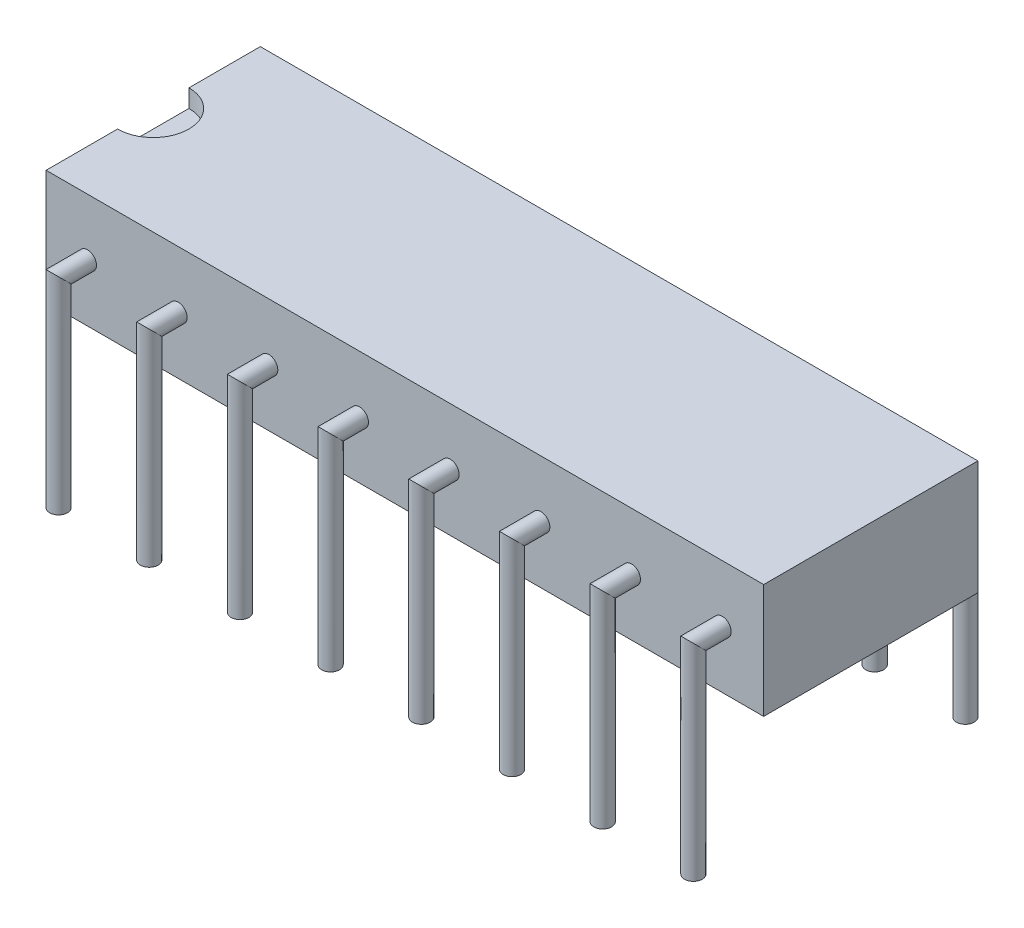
ISO-10303-21;
HEADER;
FILE_DESCRIPTION(('STEP AP214'),'2;1');
FILE_NAME('part.step','',(''),(''),'','','');
FILE_SCHEMA(('AUTOMOTIVE_DESIGN { 1 0 10303 214 1 1 1 1 }'));
ENDSEC;
DATA;
#1=APPLICATION_CONTEXT('core data for automotive mechanical design processes');
#2=APPLICATION_PROTOCOL_DEFINITION('international standard','automotive_design',2000,#1);
#3=PRODUCT_CONTEXT('',#1,'mechanical');
#4=PRODUCT('Part','Part','',(#3));
#5=PRODUCT_RELATED_PRODUCT_CATEGORY('part','',(#4));
#6=PRODUCT_DEFINITION_FORMATION('','',#4);
#7=PRODUCT_DEFINITION_CONTEXT('part definition',#1,'design');
#8=PRODUCT_DEFINITION('design','',#6,#7);
#9=PRODUCT_DEFINITION_SHAPE('','',#8);
#10=(LENGTH_UNIT() NAMED_UNIT(*) SI_UNIT(.MILLI.,.METRE.));
#11=(NAMED_UNIT(*) PLANE_ANGLE_UNIT() SI_UNIT($,.RADIAN.));
#12=(NAMED_UNIT(*) SI_UNIT($,.STERADIAN.) SOLID_ANGLE_UNIT());
#13=UNCERTAINTY_MEASURE_WITH_UNIT(LENGTH_MEASURE(1.E-05),#10,'distance_accuracy_value','');
#14=(GEOMETRIC_REPRESENTATION_CONTEXT(3) GLOBAL_UNCERTAINTY_ASSIGNED_CONTEXT((#13)) GLOBAL_UNIT_ASSIGNED_CONTEXT((#10,
#11,#12)) REPRESENTATION_CONTEXT('',''));
#15=CARTESIAN_POINT('',(0.,0.,0.));
#16=DIRECTION('',(0.,0.,1.));
#17=DIRECTION('',(1.,0.,0.));
#18=AXIS2_PLACEMENT_3D('',#15,#16,#17);
#19=CARTESIAN_POINT('',(20.1,3.2,3.));
#20=DIRECTION('',(0.,0.,-1.));
#21=DIRECTION('',(-1.,0.,0.));
#22=AXIS2_PLACEMENT_3D('',#19,#20,#21);
#23=PLANE('',#22);
#24=CARTESIAN_POINT('',(16.4,1.6,3.));
#25=DIRECTION('',(0.,0.,-1.));
#26=DIRECTION('',(-1.,0.,0.));
#27=AXIS2_PLACEMENT_3D('',#24,#25,#26);
#28=CIRCLE('',#27,0.25);
#29=CARTESIAN_POINT('',(16.15,1.6,3.));
#30=VERTEX_POINT('',#29);
#31=EDGE_CURVE('E57',#30,#30,#28,.F.);
#32=ORIENTED_EDGE('',*,*,#31,.F.);
#33=EDGE_LOOP('',(#32));
#34=FACE_BOUND('',#33,.T.);
#35=CARTESIAN_POINT('',(11.32,1.6,3.));
#36=DIRECTION('',(0.,0.,-1.));
#37=DIRECTION('',(-1.,0.,0.));
#38=AXIS2_PLACEMENT_3D('',#35,#36,#37);
#39=CIRCLE('',#38,0.25);
#40=CARTESIAN_POINT('',(11.07,1.6,3.));
#41=VERTEX_POINT('',#40);
#42=EDGE_CURVE('E166',#41,#41,#39,.F.);
#43=ORIENTED_EDGE('',*,*,#42,.F.);
#44=EDGE_LOOP('',(#43));
#45=FACE_BOUND('',#44,.T.);
#46=CARTESIAN_POINT('',(6.24,1.6,3.));
#47=DIRECTION('',(0.,0.,-1.));
#48=DIRECTION('',(-1.,0.,0.));
#49=AXIS2_PLACEMENT_3D('',#46,#47,#48);
#50=CIRCLE('',#49,0.25);
#51=CARTESIAN_POINT('',(5.99,1.6,3.));
#52=VERTEX_POINT('',#51);
#53=EDGE_CURVE('E160',#52,#52,#50,.F.);
#54=ORIENTED_EDGE('',*,*,#53,.F.);
#55=EDGE_LOOP('',(#54));
#56=FACE_BOUND('',#55,.T.);
#57=CARTESIAN_POINT('',(1.16,1.6,3.));
#58=DIRECTION('',(0.,0.,-1.));
#59=DIRECTION('',(-1.,0.,0.));
#60=AXIS2_PLACEMENT_3D('',#57,#58,#59);
#61=CIRCLE('',#60,0.25);
#62=CARTESIAN_POINT('',(0.91,1.6,3.));
#63=VERTEX_POINT('',#62);
#64=EDGE_CURVE('E154',#63,#63,#61,.F.);
#65=ORIENTED_EDGE('',*,*,#64,.F.);
#66=EDGE_LOOP('',(#65));
#67=FACE_BOUND('',#66,.T.);
#68=DIRECTION('',(0.,-1.,0.));
#69=VECTOR('',#68,1.);
#70=CARTESIAN_POINT('',(0.,3.2,3.));
#71=LINE('',#70,#69);
#72=CARTESIAN_POINT('',(0.,3.2,3.));
#73=VERTEX_POINT('',#72);
#74=CARTESIAN_POINT('',(0.,0.,3.));
#75=VERTEX_POINT('',#74);
#76=EDGE_CURVE('E124',#73,#75,#71,.T.);
#77=ORIENTED_EDGE('',*,*,#76,.T.);
#78=DIRECTION('',(-1.,0.,0.));
#79=VECTOR('',#78,1.);
#80=CARTESIAN_POINT('',(20.1,0.,3.));
#81=LINE('',#80,#79);
#82=CARTESIAN_POINT('',(20.1,0.,3.));
#83=VERTEX_POINT('',#82);
#84=EDGE_CURVE('E152',#83,#75,#81,.T.);
#85=ORIENTED_EDGE('',*,*,#84,.F.);
#86=DIRECTION('',(0.,-1.,0.));
#87=VECTOR('',#86,1.);
#88=CARTESIAN_POINT('',(20.1,3.2,3.));
#89=LINE('',#88,#87);
#90=CARTESIAN_POINT('',(20.1,3.2,3.));
#91=VERTEX_POINT('',#90);
#92=EDGE_CURVE('E132',#91,#83,#89,.T.);
#93=ORIENTED_EDGE('',*,*,#92,.F.);
#94=DIRECTION('',(-1.,0.,0.));
#95=VECTOR('',#94,1.);
#96=CARTESIAN_POINT('',(20.1,3.2,3.));
#97=LINE('',#96,#95);
#98=EDGE_CURVE('E138',#91,#73,#97,.T.);
#99=ORIENTED_EDGE('',*,*,#98,.T.);
#100=EDGE_LOOP('',(#77,#85,#93,#99));
#101=FACE_BOUND('',#100,.T.);
#102=CARTESIAN_POINT('',(3.7,1.6,3.));
#103=DIRECTION('',(0.,0.,-1.));
#104=DIRECTION('',(-1.,0.,0.));
#105=AXIS2_PLACEMENT_3D('',#102,#103,#104);
#106=CIRCLE('',#105,0.25);
#107=CARTESIAN_POINT('',(3.45,1.6,3.));
#108=VERTEX_POINT('',#107);
#109=EDGE_CURVE('E157',#108,#108,#106,.F.);
#110=ORIENTED_EDGE('',*,*,#109,.F.);
#111=EDGE_LOOP('',(#110));
#112=FACE_BOUND('',#111,.T.);
#113=CARTESIAN_POINT('',(8.78,1.6,3.));
#114=DIRECTION('',(0.,0.,-1.));
#115=DIRECTION('',(-1.,0.,0.));
#116=AXIS2_PLACEMENT_3D('',#113,#114,#115);
#117=CIRCLE('',#116,0.25);
#118=CARTESIAN_POINT('',(8.53,1.6,3.));
#119=VERTEX_POINT('',#118);
#120=EDGE_CURVE('E163',#119,#119,#117,.F.);
#121=ORIENTED_EDGE('',*,*,#120,.F.);
#122=EDGE_LOOP('',(#121));
#123=FACE_BOUND('',#122,.T.);
#124=CARTESIAN_POINT('',(13.86,1.6,3.));
#125=DIRECTION('',(0.,0.,-1.));
#126=DIRECTION('',(-1.,0.,0.));
#127=AXIS2_PLACEMENT_3D('',#124,#125,#126);
#128=CIRCLE('',#127,0.25);
#129=CARTESIAN_POINT('',(13.61,1.6,3.));
#130=VERTEX_POINT('',#129);
#131=EDGE_CURVE('E169',#130,#130,#128,.F.);
#132=ORIENTED_EDGE('',*,*,#131,.F.);
#133=EDGE_LOOP('',(#132));
#134=FACE_BOUND('',#133,.T.);
#135=CARTESIAN_POINT('',(18.94,1.6,3.));
#136=DIRECTION('',(0.,0.,-1.));
#137=DIRECTION('',(-1.,0.,0.));
#138=AXIS2_PLACEMENT_3D('',#135,#136,#137);
#139=CIRCLE('',#138,0.25);
#140=CARTESIAN_POINT('',(18.69,1.6,3.));
#141=VERTEX_POINT('',#140);
#142=EDGE_CURVE('E12',#141,#141,#139,.F.);
#143=ORIENTED_EDGE('',*,*,#142,.F.);
#144=EDGE_LOOP('',(#143));
#145=FACE_BOUND('',#144,.T.);
#146=ADVANCED_FACE('F50',(#34,#45,#56,#67,#101,#112,#123,#134,#145),#23,.F.);
#147=CARTESIAN_POINT('',(20.1,0.,3.));
#148=DIRECTION('',(0.,1.,0.));
#149=DIRECTION('',(0.,0.,1.));
#150=AXIS2_PLACEMENT_3D('',#147,#148,#149);
#151=PLANE('',#150);
#152=DIRECTION('',(0.,0.,-1.));
#153=VECTOR('',#152,1.);
#154=CARTESIAN_POINT('',(0.,0.,3.));
#155=LINE('',#154,#153);
#156=CARTESIAN_POINT('',(0.,0.,-3.));
#157=VERTEX_POINT('',#156);
#158=EDGE_CURVE('E127',#75,#157,#155,.T.);
#159=ORIENTED_EDGE('',*,*,#158,.T.);
#160=DIRECTION('',(-1.,0.,0.));
#161=VECTOR('',#160,1.);
#162=CARTESIAN_POINT('',(20.1,0.,-3.));
#163=LINE('',#162,#161);
#164=CARTESIAN_POINT('',(20.1,0.,-3.));
#165=VERTEX_POINT('',#164);
#166=EDGE_CURVE('E149',#165,#157,#163,.T.);
#167=ORIENTED_EDGE('',*,*,#166,.F.);
#168=DIRECTION('',(0.,0.,-1.));
#169=VECTOR('',#168,1.);
#170=CARTESIAN_POINT('',(20.1,0.,3.));
#171=LINE('',#170,#169);
#172=EDGE_CURVE('E101',#83,#165,#171,.T.);
#173=ORIENTED_EDGE('',*,*,#172,.F.);
#174=ORIENTED_EDGE('',*,*,#84,.T.);
#175=EDGE_LOOP('',(#159,#167,#173,#174));
#176=FACE_BOUND('',#175,.T.);
#177=ADVANCED_FACE('F179',(#176),#151,.F.);
#178=CARTESIAN_POINT('',(20.1,3.2,-3.));
#179=DIRECTION('',(0.,0.,1.));
#180=DIRECTION('',(1.,0.,0.));
#181=AXIS2_PLACEMENT_3D('',#178,#179,#180);
#182=PLANE('',#181);
#183=CARTESIAN_POINT('',(18.94,1.6,-3.));
#184=DIRECTION('',(0.,0.,1.));
#185=DIRECTION('',(1.,0.,0.));
#186=AXIS2_PLACEMENT_3D('',#183,#184,#185);
#187=CIRCLE('',#186,0.25);
#188=CARTESIAN_POINT('',(19.19,1.6,-3.));
#189=VERTEX_POINT('',#188);
#190=EDGE_CURVE('E815',#189,#189,#187,.T.);
#191=ORIENTED_EDGE('',*,*,#190,.T.);
#192=EDGE_LOOP('',(#191));
#193=FACE_BOUND('',#192,.T.);
#194=CARTESIAN_POINT('',(16.4,1.6,-3.));
#195=DIRECTION('',(0.,0.,1.));
#196=DIRECTION('',(1.,0.,0.));
#197=AXIS2_PLACEMENT_3D('',#194,#195,#196);
#198=CIRCLE('',#197,0.25);
#199=CARTESIAN_POINT('',(16.65,1.6,-3.));
#200=VERTEX_POINT('',#199);
#201=EDGE_CURVE('E808',#200,#200,#198,.T.);
#202=ORIENTED_EDGE('',*,*,#201,.T.);
#203=EDGE_LOOP('',(#202));
#204=FACE_BOUND('',#203,.T.);
#205=CARTESIAN_POINT('',(13.86,1.6,-3.));
#206=DIRECTION('',(0.,0.,1.));
#207=DIRECTION('',(1.,0.,0.));
#208=AXIS2_PLACEMENT_3D('',#205,#206,#207);
#209=CIRCLE('',#208,0.25);
#210=CARTESIAN_POINT('',(14.11,1.6,-3.));
#211=VERTEX_POINT('',#210);
#212=EDGE_CURVE('E824',#211,#211,#209,.T.);
#213=ORIENTED_EDGE('',*,*,#212,.T.);
#214=EDGE_LOOP('',(#213));
#215=FACE_BOUND('',#214,.T.);
#216=CARTESIAN_POINT('',(11.32,1.6,-3.));
#217=DIRECTION('',(0.,0.,1.));
#218=DIRECTION('',(1.,0.,0.));
#219=AXIS2_PLACEMENT_3D('',#216,#217,#218);
#220=CIRCLE('',#219,0.25);
#221=CARTESIAN_POINT('',(11.57,1.6,-3.));
#222=VERTEX_POINT('',#221);
#223=EDGE_CURVE('E833',#222,#222,#220,.T.);
#224=ORIENTED_EDGE('',*,*,#223,.T.);
#225=EDGE_LOOP('',(#224));
#226=FACE_BOUND('',#225,.T.);
#227=CARTESIAN_POINT('',(8.78,1.6,-3.));
#228=DIRECTION('',(0.,0.,1.));
#229=DIRECTION('',(1.,0.,0.));
#230=AXIS2_PLACEMENT_3D('',#227,#228,#229);
#231=CIRCLE('',#230,0.25);
#232=CARTESIAN_POINT('',(9.03,1.6,-3.));
#233=VERTEX_POINT('',#232);
#234=EDGE_CURVE('E842',#233,#233,#231,.T.);
#235=ORIENTED_EDGE('',*,*,#234,.T.);
#236=EDGE_LOOP('',(#235));
#237=FACE_BOUND('',#236,.T.);
#238=CARTESIAN_POINT('',(6.24,1.6,-3.));
#239=DIRECTION('',(0.,0.,1.));
#240=DIRECTION('',(1.,0.,0.));
#241=AXIS2_PLACEMENT_3D('',#238,#239,#240);
#242=CIRCLE('',#241,0.25);
#243=CARTESIAN_POINT('',(6.49,1.6,-3.));
#244=VERTEX_POINT('',#243);
#245=EDGE_CURVE('E851',#244,#244,#242,.T.);
#246=ORIENTED_EDGE('',*,*,#245,.T.);
#247=EDGE_LOOP('',(#246));
#248=FACE_BOUND('',#247,.T.);
#249=CARTESIAN_POINT('',(3.7,1.6,-3.));
#250=DIRECTION('',(0.,0.,1.));
#251=DIRECTION('',(1.,0.,0.));
#252=AXIS2_PLACEMENT_3D('',#249,#250,#251);
#253=CIRCLE('',#252,0.25);
#254=CARTESIAN_POINT('',(3.95,1.6,-3.));
#255=VERTEX_POINT('',#254);
#256=EDGE_CURVE('E860',#255,#255,#253,.T.);
#257=ORIENTED_EDGE('',*,*,#256,.T.);
#258=EDGE_LOOP('',(#257));
#259=FACE_BOUND('',#258,.T.);
#260=CARTESIAN_POINT('',(1.16,1.6,-3.));
#261=DIRECTION('',(0.,0.,1.));
#262=DIRECTION('',(1.,0.,0.));
#263=AXIS2_PLACEMENT_3D('',#260,#261,#262);
#264=CIRCLE('',#263,0.25);
#265=CARTESIAN_POINT('',(1.41,1.6,-3.));
#266=VERTEX_POINT('',#265);
#267=EDGE_CURVE('E252',#266,#266,#264,.T.);
#268=ORIENTED_EDGE('',*,*,#267,.T.);
#269=EDGE_LOOP('',(#268));
#270=FACE_BOUND('',#269,.T.);
#271=DIRECTION('',(0.,1.,0.));
#272=VECTOR('',#271,1.);
#273=CARTESIAN_POINT('',(0.,3.2,-3.));
#274=LINE('',#273,#272);
#275=CARTESIAN_POINT('',(0.,3.2,-3.));
#276=VERTEX_POINT('',#275);
#277=EDGE_CURVE('E141',#157,#276,#274,.T.);
#278=ORIENTED_EDGE('',*,*,#277,.T.);
#279=DIRECTION('',(-1.,0.,0.));
#280=VECTOR('',#279,1.);
#281=CARTESIAN_POINT('',(20.1,3.2,-3.));
#282=LINE('',#281,#280);
#283=CARTESIAN_POINT('',(20.1,3.2,-3.));
#284=VERTEX_POINT('',#283);
#285=EDGE_CURVE('E146',#284,#276,#282,.T.);
#286=ORIENTED_EDGE('',*,*,#285,.F.);
#287=DIRECTION('',(0.,1.,0.));
#288=VECTOR('',#287,1.);
#289=CARTESIAN_POINT('',(20.1,3.2,-3.));
#290=LINE('',#289,#288);
#291=EDGE_CURVE('E136',#165,#284,#290,.T.);
#292=ORIENTED_EDGE('',*,*,#291,.F.);
#293=ORIENTED_EDGE('',*,*,#166,.T.);
#294=EDGE_LOOP('',(#278,#286,#292,#293));
#295=FACE_BOUND('',#294,.T.);
#296=ADVANCED_FACE('F274',(#193,#204,#215,#226,#237,#248,#259,#270,#295),#182,.F.);
#297=CARTESIAN_POINT('',(20.1,3.2,3.));
#298=DIRECTION('',(0.,-1.,0.));
#299=DIRECTION('',(0.,0.,-1.));
#300=AXIS2_PLACEMENT_3D('',#297,#298,#299);
#301=PLANE('',#300);
#302=DIRECTION('',(0.,0.,1.));
#303=VECTOR('',#302,1.);
#304=CARTESIAN_POINT('',(0.,3.2,3.));
#305=LINE('',#304,#303);
#306=CARTESIAN_POINT('',(0.,3.2,-1.));
#307=VERTEX_POINT('',#306);
#308=EDGE_CURVE('E134',#276,#307,#305,.T.);
#309=ORIENTED_EDGE('',*,*,#308,.T.);
#310=CARTESIAN_POINT('',(0.,3.2,0.));
#311=DIRECTION('',(0.,1.,0.));
#312=DIRECTION('',(0.,0.,1.));
#313=AXIS2_PLACEMENT_3D('',#310,#311,#312);
#314=CIRCLE('',#313,1.);
#315=CARTESIAN_POINT('',(0.,3.2,1.));
#316=VERTEX_POINT('',#315);
#317=EDGE_CURVE('E117',#316,#307,#314,.T.);
#318=ORIENTED_EDGE('',*,*,#317,.F.);
#319=EDGE_CURVE('E93',#316,#73,#305,.T.);
#320=ORIENTED_EDGE('',*,*,#319,.T.);
#321=ORIENTED_EDGE('',*,*,#98,.F.);
#322=DIRECTION('',(0.,0.,1.));
#323=VECTOR('',#322,1.);
#324=CARTESIAN_POINT('',(20.1,3.2,3.));
#325=LINE('',#324,#323);
#326=EDGE_CURVE('E72',#284,#91,#325,.T.);
#327=ORIENTED_EDGE('',*,*,#326,.F.);
#328=ORIENTED_EDGE('',*,*,#285,.T.);
#329=EDGE_LOOP('',(#309,#318,#320,#321,#327,#328));
#330=FACE_BOUND('',#329,.T.);
#331=ADVANCED_FACE('F270',(#330),#301,.F.);
#332=CARTESIAN_POINT('',(20.1,0.,3.));
#333=DIRECTION('',(1.,0.,0.));
#334=DIRECTION('',(0.,0.,-1.));
#335=AXIS2_PLACEMENT_3D('',#332,#333,#334);
#336=PLANE('',#335);
#337=ORIENTED_EDGE('',*,*,#92,.T.);
#338=ORIENTED_EDGE('',*,*,#172,.T.);
#339=ORIENTED_EDGE('',*,*,#291,.T.);
#340=ORIENTED_EDGE('',*,*,#326,.T.);
#341=EDGE_LOOP('',(#337,#338,#339,#340));
#342=FACE_BOUND('',#341,.T.);
#343=ADVANCED_FACE('F276',(#342),#336,.T.);
#344=CARTESIAN_POINT('',(0.,0.,3.));
#345=DIRECTION('',(1.,0.,0.));
#346=DIRECTION('',(0.,0.,-1.));
#347=AXIS2_PLACEMENT_3D('',#344,#345,#346);
#348=PLANE('',#347);
#349=DIRECTION('',(0.,0.,1.));
#350=VECTOR('',#349,1.);
#351=CARTESIAN_POINT('',(0.,2.7,-1.));
#352=LINE('',#351,#350);
#353=CARTESIAN_POINT('',(0.,2.7,-1.));
#354=VERTEX_POINT('',#353);
#355=CARTESIAN_POINT('',(0.,2.7,1.));
#356=VERTEX_POINT('',#355);
#357=EDGE_CURVE('E116',#354,#356,#352,.T.);
#358=ORIENTED_EDGE('',*,*,#357,.F.);
#359=DIRECTION('',(0.,1.,0.));
#360=VECTOR('',#359,1.);
#361=CARTESIAN_POINT('',(0.,2.7,-1.));
#362=LINE('',#361,#360);
#363=EDGE_CURVE('E114',#354,#307,#362,.T.);
#364=ORIENTED_EDGE('',*,*,#363,.T.);
#365=ORIENTED_EDGE('',*,*,#308,.F.);
#366=ORIENTED_EDGE('',*,*,#277,.F.);
#367=ORIENTED_EDGE('',*,*,#158,.F.);
#368=ORIENTED_EDGE('',*,*,#76,.F.);
#369=ORIENTED_EDGE('',*,*,#319,.F.);
#370=DIRECTION('',(0.,1.,0.));
#371=VECTOR('',#370,1.);
#372=CARTESIAN_POINT('',(0.,2.7,1.));
#373=LINE('',#372,#371);
#374=EDGE_CURVE('E112',#356,#316,#373,.T.);
#375=ORIENTED_EDGE('',*,*,#374,.F.);
#376=EDGE_LOOP('',(#358,#364,#365,#366,#367,#368,#369,#375));
#377=FACE_BOUND('',#376,.T.);
#378=ADVANCED_FACE('F122',(#377),#348,.F.);
#379=CARTESIAN_POINT('',(0.,2.7,0.));
#380=DIRECTION('',(0.,1.,0.));
#381=DIRECTION('',(0.,0.,1.));
#382=AXIS2_PLACEMENT_3D('',#379,#380,#381);
#383=CYLINDRICAL_SURFACE('',#382,1.);
#384=ORIENTED_EDGE('',*,*,#317,.T.);
#385=ORIENTED_EDGE('',*,*,#363,.F.);
#386=CARTESIAN_POINT('',(0.,2.7,0.));
#387=DIRECTION('',(0.,1.,0.));
#388=DIRECTION('',(0.,0.,1.));
#389=AXIS2_PLACEMENT_3D('',#386,#387,#388);
#390=CIRCLE('',#389,1.);
#391=EDGE_CURVE('E63',#356,#354,#390,.T.);
#392=ORIENTED_EDGE('',*,*,#391,.F.);
#393=ORIENTED_EDGE('',*,*,#374,.T.);
#394=EDGE_LOOP('',(#384,#385,#392,#393));
#395=FACE_BOUND('',#394,.T.);
#396=ADVANCED_FACE('F110',(#395),#383,.F.);
#397=CARTESIAN_POINT('',(0.,2.7,0.));
#398=DIRECTION('',(0.,1.,0.));
#399=DIRECTION('',(0.,0.,1.));
#400=AXIS2_PLACEMENT_3D('',#397,#398,#399);
#401=PLANE('',#400);
#402=ORIENTED_EDGE('',*,*,#391,.T.);
#403=ORIENTED_EDGE('',*,*,#357,.T.);
#404=EDGE_LOOP('',(#402,#403));
#405=FACE_BOUND('',#404,.T.);
#406=ADVANCED_FACE('F119',(#405),#401,.T.);
#407=CARTESIAN_POINT('',(1.16,1.6,3.81));
#408=DIRECTION('',(0.,-1.,0.));
#409=DIRECTION('',(0.,0.,-1.));
#410=AXIS2_PLACEMENT_3D('',#407,#408,#409);
#411=CYLINDRICAL_SURFACE('',#410,0.25);
#412=CARTESIAN_POINT('',(1.16,1.6,3.81));
#413=DIRECTION('',(0.,-0.707106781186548,0.707106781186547));
#414=DIRECTION('',(0.,-0.707106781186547,-0.707106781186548));
#415=AXIS2_PLACEMENT_3D('',#412,#413,#414);
#416=ELLIPSE('',#415,0.353553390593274,0.25);
#417=CARTESIAN_POINT('',(1.16,1.35,3.56));
#418=VERTEX_POINT('',#417);
#419=EDGE_CURVE('E261',#418,#418,#416,.T.);
#420=ORIENTED_EDGE('',*,*,#419,.T.);
#421=EDGE_LOOP('',(#420));
#422=FACE_BOUND('',#421,.T.);
#423=CARTESIAN_POINT('',(1.16,-4.,3.81));
#424=DIRECTION('',(0.,-1.,0.));
#425=DIRECTION('',(0.,0.,-1.));
#426=AXIS2_PLACEMENT_3D('',#423,#424,#425);
#427=CIRCLE('',#426,0.25);
#428=CARTESIAN_POINT('',(1.16,-4.,3.56));
#429=VERTEX_POINT('',#428);
#430=EDGE_CURVE('E264',#429,#429,#427,.F.);
#431=ORIENTED_EDGE('',*,*,#430,.T.);
#432=EDGE_LOOP('',(#431));
#433=FACE_BOUND('',#432,.T.);
#434=ADVANCED_FACE('F328',(#422,#433),#411,.T.);
#435=CARTESIAN_POINT('',(1.16,1.6,4.51710678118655));
#436=DIRECTION('',(0.,0.,-1.));
#437=DIRECTION('',(0.,1.,0.));
#438=AXIS2_PLACEMENT_3D('',#435,#436,#437);
#439=CYLINDRICAL_SURFACE('',#438,0.25);
#440=ORIENTED_EDGE('',*,*,#64,.T.);
#441=EDGE_LOOP('',(#440));
#442=FACE_BOUND('',#441,.T.);
#443=ORIENTED_EDGE('',*,*,#419,.F.);
#444=EDGE_LOOP('',(#443));
#445=FACE_BOUND('',#444,.T.);
#446=ADVANCED_FACE('F336',(#442,#445),#439,.T.);
#447=CARTESIAN_POINT('',(1.16,-4.,3.81));
#448=DIRECTION('',(0.,-1.,0.));
#449=DIRECTION('',(0.,0.,-1.));
#450=AXIS2_PLACEMENT_3D('',#447,#448,#449);
#451=PLANE('',#450);
#452=ORIENTED_EDGE('',*,*,#430,.F.);
#453=EDGE_LOOP('',(#452));
#454=FACE_BOUND('',#453,.T.);
#455=ADVANCED_FACE('F346',(#454),#451,.T.);
#456=CARTESIAN_POINT('',(1.16,1.6,-3.81));
#457=DIRECTION('',(0.,-1.,0.));
#458=DIRECTION('',(0.,0.,-1.));
#459=AXIS2_PLACEMENT_3D('',#456,#457,#458);
#460=CYLINDRICAL_SURFACE('',#459,0.25);
#461=CARTESIAN_POINT('',(1.16,1.6,-3.81));
#462=DIRECTION('',(0.,-0.707106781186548,-0.707106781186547));
#463=DIRECTION('',(0.,-0.707106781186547,0.707106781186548));
#464=AXIS2_PLACEMENT_3D('',#461,#462,#463);
#465=ELLIPSE('',#464,0.353553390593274,0.25);
#466=CARTESIAN_POINT('',(1.16,1.35,-3.56));
#467=VERTEX_POINT('',#466);
#468=EDGE_CURVE('E255',#467,#467,#465,.F.);
#469=ORIENTED_EDGE('',*,*,#468,.F.);
#470=EDGE_LOOP('',(#469));
#471=FACE_BOUND('',#470,.T.);
#472=CARTESIAN_POINT('',(1.16,-4.,-3.81));
#473=DIRECTION('',(0.,-1.,0.));
#474=DIRECTION('',(0.,0.,-1.));
#475=AXIS2_PLACEMENT_3D('',#472,#473,#474);
#476=CIRCLE('',#475,0.25);
#477=CARTESIAN_POINT('',(1.16,-4.,-4.06));
#478=VERTEX_POINT('',#477);
#479=EDGE_CURVE('E258',#478,#478,#476,.T.);
#480=ORIENTED_EDGE('',*,*,#479,.F.);
#481=EDGE_LOOP('',(#480));
#482=FACE_BOUND('',#481,.T.);
#483=ADVANCED_FACE('F356',(#471,#482),#460,.T.);
#484=CARTESIAN_POINT('',(1.16,1.6,-4.51710678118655));
#485=DIRECTION('',(0.,0.,1.));
#486=DIRECTION('',(0.,-1.,0.));
#487=AXIS2_PLACEMENT_3D('',#484,#485,#486);
#488=CYLINDRICAL_SURFACE('',#487,0.25);
#489=ORIENTED_EDGE('',*,*,#267,.F.);
#490=EDGE_LOOP('',(#489));
#491=FACE_BOUND('',#490,.T.);
#492=ORIENTED_EDGE('',*,*,#468,.T.);
#493=EDGE_LOOP('',(#492));
#494=FACE_BOUND('',#493,.T.);
#495=ADVANCED_FACE('F366',(#491,#494),#488,.T.);
#496=CARTESIAN_POINT('',(1.16,-4.,-3.81));
#497=DIRECTION('',(0.,-1.,0.));
#498=DIRECTION('',(0.,0.,-1.));
#499=AXIS2_PLACEMENT_3D('',#496,#497,#498);
#500=PLANE('',#499);
#501=ORIENTED_EDGE('',*,*,#479,.T.);
#502=EDGE_LOOP('',(#501));
#503=FACE_BOUND('',#502,.T.);
#504=ADVANCED_FACE('F376',(#503),#500,.T.);
#505=CARTESIAN_POINT('',(3.7,1.6,3.81));
#506=DIRECTION('',(0.,-1.,0.));
#507=DIRECTION('',(0.,0.,-1.));
#508=AXIS2_PLACEMENT_3D('',#505,#506,#507);
#509=CYLINDRICAL_SURFACE('',#508,0.25);
#510=CARTESIAN_POINT('',(3.7,1.6,3.81));
#511=DIRECTION('',(0.,-0.707106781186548,0.707106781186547));
#512=DIRECTION('',(0.,-0.707106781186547,-0.707106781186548));
#513=AXIS2_PLACEMENT_3D('',#510,#511,#512);
#514=ELLIPSE('',#513,0.353553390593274,0.25);
#515=CARTESIAN_POINT('',(3.7,1.35,3.56));
#516=VERTEX_POINT('',#515);
#517=EDGE_CURVE('E246',#516,#516,#514,.T.);
#518=ORIENTED_EDGE('',*,*,#517,.T.);
#519=EDGE_LOOP('',(#518));
#520=FACE_BOUND('',#519,.T.);
#521=CARTESIAN_POINT('',(3.7,-4.,3.81));
#522=DIRECTION('',(0.,-1.,0.));
#523=DIRECTION('',(0.,0.,-1.));
#524=AXIS2_PLACEMENT_3D('',#521,#522,#523);
#525=CIRCLE('',#524,0.25);
#526=CARTESIAN_POINT('',(3.7,-4.,3.56));
#527=VERTEX_POINT('',#526);
#528=EDGE_CURVE('E249',#527,#527,#525,.F.);
#529=ORIENTED_EDGE('',*,*,#528,.T.);
#530=EDGE_LOOP('',(#529));
#531=FACE_BOUND('',#530,.T.);
#532=ADVANCED_FACE('F385',(#520,#531),#509,.T.);
#533=CARTESIAN_POINT('',(3.7,1.6,4.51710678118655));
#534=DIRECTION('',(0.,0.,-1.));
#535=DIRECTION('',(0.,1.,0.));
#536=AXIS2_PLACEMENT_3D('',#533,#534,#535);
#537=CYLINDRICAL_SURFACE('',#536,0.25);
#538=ORIENTED_EDGE('',*,*,#109,.T.);
#539=EDGE_LOOP('',(#538));
#540=FACE_BOUND('',#539,.T.);
#541=ORIENTED_EDGE('',*,*,#517,.F.);
#542=EDGE_LOOP('',(#541));
#543=FACE_BOUND('',#542,.T.);
#544=ADVANCED_FACE('F400',(#540,#543),#537,.T.);
#545=CARTESIAN_POINT('',(3.7,-4.,3.81));
#546=DIRECTION('',(0.,-1.,0.));
#547=DIRECTION('',(0.,0.,-1.));
#548=AXIS2_PLACEMENT_3D('',#545,#546,#547);
#549=PLANE('',#548);
#550=ORIENTED_EDGE('',*,*,#528,.F.);
#551=EDGE_LOOP('',(#550));
#552=FACE_BOUND('',#551,.T.);
#553=ADVANCED_FACE('F409',(#552),#549,.T.);
#554=CARTESIAN_POINT('',(6.24,1.6,3.81));
#555=DIRECTION('',(0.,-1.,0.));
#556=DIRECTION('',(0.,0.,-1.));
#557=AXIS2_PLACEMENT_3D('',#554,#555,#556);
#558=CYLINDRICAL_SURFACE('',#557,0.25);
#559=CARTESIAN_POINT('',(6.24,1.6,3.81));
#560=DIRECTION('',(0.,-0.707106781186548,0.707106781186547));
#561=DIRECTION('',(0.,-0.707106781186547,-0.707106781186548));
#562=AXIS2_PLACEMENT_3D('',#559,#560,#561);
#563=ELLIPSE('',#562,0.353553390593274,0.25);
#564=CARTESIAN_POINT('',(6.24,1.35,3.56));
#565=VERTEX_POINT('',#564);
#566=EDGE_CURVE('E240',#565,#565,#563,.T.);
#567=ORIENTED_EDGE('',*,*,#566,.T.);
#568=EDGE_LOOP('',(#567));
#569=FACE_BOUND('',#568,.T.);
#570=CARTESIAN_POINT('',(6.24,-4.,3.81));
#571=DIRECTION('',(0.,-1.,0.));
#572=DIRECTION('',(0.,0.,-1.));
#573=AXIS2_PLACEMENT_3D('',#570,#571,#572);
#574=CIRCLE('',#573,0.25);
#575=CARTESIAN_POINT('',(6.24,-4.,3.56));
#576=VERTEX_POINT('',#575);
#577=EDGE_CURVE('E243',#576,#576,#574,.F.);
#578=ORIENTED_EDGE('',*,*,#577,.T.);
#579=EDGE_LOOP('',(#578));
#580=FACE_BOUND('',#579,.T.);
#581=ADVANCED_FACE('F418',(#569,#580),#558,.T.);
#582=CARTESIAN_POINT('',(6.24,1.6,4.51710678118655));
#583=DIRECTION('',(0.,0.,-1.));
#584=DIRECTION('',(0.,1.,0.));
#585=AXIS2_PLACEMENT_3D('',#582,#583,#584);
#586=CYLINDRICAL_SURFACE('',#585,0.25);
#587=ORIENTED_EDGE('',*,*,#53,.T.);
#588=EDGE_LOOP('',(#587));
#589=FACE_BOUND('',#588,.T.);
#590=ORIENTED_EDGE('',*,*,#566,.F.);
#591=EDGE_LOOP('',(#590));
#592=FACE_BOUND('',#591,.T.);
#593=ADVANCED_FACE('F427',(#589,#592),#586,.T.);
#594=CARTESIAN_POINT('',(6.24,-4.,3.81));
#595=DIRECTION('',(0.,-1.,0.));
#596=DIRECTION('',(0.,0.,-1.));
#597=AXIS2_PLACEMENT_3D('',#594,#595,#596);
#598=PLANE('',#597);
#599=ORIENTED_EDGE('',*,*,#577,.F.);
#600=EDGE_LOOP('',(#599));
#601=FACE_BOUND('',#600,.T.);
#602=ADVANCED_FACE('F436',(#601),#598,.T.);
#603=CARTESIAN_POINT('',(8.78,1.6,3.81));
#604=DIRECTION('',(0.,-1.,0.));
#605=DIRECTION('',(0.,0.,-1.));
#606=AXIS2_PLACEMENT_3D('',#603,#604,#605);
#607=CYLINDRICAL_SURFACE('',#606,0.25);
#608=CARTESIAN_POINT('',(8.78,1.6,3.81));
#609=DIRECTION('',(0.,-0.707106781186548,0.707106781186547));
#610=DIRECTION('',(0.,-0.707106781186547,-0.707106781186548));
#611=AXIS2_PLACEMENT_3D('',#608,#609,#610);
#612=ELLIPSE('',#611,0.353553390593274,0.25);
#613=CARTESIAN_POINT('',(8.78,1.35,3.56));
#614=VERTEX_POINT('',#613);
#615=EDGE_CURVE('E234',#614,#614,#612,.T.);
#616=ORIENTED_EDGE('',*,*,#615,.T.);
#617=EDGE_LOOP('',(#616));
#618=FACE_BOUND('',#617,.T.);
#619=CARTESIAN_POINT('',(8.78,-4.,3.81));
#620=DIRECTION('',(0.,-1.,0.));
#621=DIRECTION('',(0.,0.,-1.));
#622=AXIS2_PLACEMENT_3D('',#619,#620,#621);
#623=CIRCLE('',#622,0.25);
#624=CARTESIAN_POINT('',(8.78,-4.,3.56));
#625=VERTEX_POINT('',#624);
#626=EDGE_CURVE('E237',#625,#625,#623,.F.);
#627=ORIENTED_EDGE('',*,*,#626,.T.);
#628=EDGE_LOOP('',(#627));
#629=FACE_BOUND('',#628,.T.);
#630=ADVANCED_FACE('F445',(#618,#629),#607,.T.);
#631=CARTESIAN_POINT('',(8.78,1.6,4.51710678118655));
#632=DIRECTION('',(0.,0.,-1.));
#633=DIRECTION('',(0.,1.,0.));
#634=AXIS2_PLACEMENT_3D('',#631,#632,#633);
#635=CYLINDRICAL_SURFACE('',#634,0.25);
#636=ORIENTED_EDGE('',*,*,#120,.T.);
#637=EDGE_LOOP('',(#636));
#638=FACE_BOUND('',#637,.T.);
#639=ORIENTED_EDGE('',*,*,#615,.F.);
#640=EDGE_LOOP('',(#639));
#641=FACE_BOUND('',#640,.T.);
#642=ADVANCED_FACE('F454',(#638,#641),#635,.T.);
#643=CARTESIAN_POINT('',(8.78,-4.,3.81));
#644=DIRECTION('',(0.,-1.,0.));
#645=DIRECTION('',(0.,0.,-1.));
#646=AXIS2_PLACEMENT_3D('',#643,#644,#645);
#647=PLANE('',#646);
#648=ORIENTED_EDGE('',*,*,#626,.F.);
#649=EDGE_LOOP('',(#648));
#650=FACE_BOUND('',#649,.T.);
#651=ADVANCED_FACE('F463',(#650),#647,.T.);
#652=CARTESIAN_POINT('',(11.32,1.6,3.81));
#653=DIRECTION('',(0.,-1.,0.));
#654=DIRECTION('',(0.,0.,-1.));
#655=AXIS2_PLACEMENT_3D('',#652,#653,#654);
#656=CYLINDRICAL_SURFACE('',#655,0.25);
#657=CARTESIAN_POINT('',(11.32,1.6,3.81));
#658=DIRECTION('',(0.,-0.707106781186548,0.707106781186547));
#659=DIRECTION('',(0.,-0.707106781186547,-0.707106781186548));
#660=AXIS2_PLACEMENT_3D('',#657,#658,#659);
#661=ELLIPSE('',#660,0.353553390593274,0.25);
#662=CARTESIAN_POINT('',(11.32,1.35,3.56));
#663=VERTEX_POINT('',#662);
#664=EDGE_CURVE('E228',#663,#663,#661,.T.);
#665=ORIENTED_EDGE('',*,*,#664,.T.);
#666=EDGE_LOOP('',(#665));
#667=FACE_BOUND('',#666,.T.);
#668=CARTESIAN_POINT('',(11.32,-4.,3.81));
#669=DIRECTION('',(0.,-1.,0.));
#670=DIRECTION('',(0.,0.,-1.));
#671=AXIS2_PLACEMENT_3D('',#668,#669,#670);
#672=CIRCLE('',#671,0.25);
#673=CARTESIAN_POINT('',(11.32,-4.,3.56));
#674=VERTEX_POINT('',#673);
#675=EDGE_CURVE('E231',#674,#674,#672,.F.);
#676=ORIENTED_EDGE('',*,*,#675,.T.);
#677=EDGE_LOOP('',(#676));
#678=FACE_BOUND('',#677,.T.);
#679=ADVANCED_FACE('F472',(#667,#678),#656,.T.);
#680=CARTESIAN_POINT('',(11.32,1.6,4.51710678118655));
#681=DIRECTION('',(0.,0.,-1.));
#682=DIRECTION('',(0.,1.,0.));
#683=AXIS2_PLACEMENT_3D('',#680,#681,#682);
#684=CYLINDRICAL_SURFACE('',#683,0.25);
#685=ORIENTED_EDGE('',*,*,#42,.T.);
#686=EDGE_LOOP('',(#685));
#687=FACE_BOUND('',#686,.T.);
#688=ORIENTED_EDGE('',*,*,#664,.F.);
#689=EDGE_LOOP('',(#688));
#690=FACE_BOUND('',#689,.T.);
#691=ADVANCED_FACE('F481',(#687,#690),#684,.T.);
#692=CARTESIAN_POINT('',(11.32,-4.,3.81));
#693=DIRECTION('',(0.,-1.,0.));
#694=DIRECTION('',(0.,0.,-1.));
#695=AXIS2_PLACEMENT_3D('',#692,#693,#694);
#696=PLANE('',#695);
#697=ORIENTED_EDGE('',*,*,#675,.F.);
#698=EDGE_LOOP('',(#697));
#699=FACE_BOUND('',#698,.T.);
#700=ADVANCED_FACE('F490',(#699),#696,.T.);
#701=CARTESIAN_POINT('',(13.86,1.6,3.81));
#702=DIRECTION('',(0.,-1.,0.));
#703=DIRECTION('',(0.,0.,-1.));
#704=AXIS2_PLACEMENT_3D('',#701,#702,#703);
#705=CYLINDRICAL_SURFACE('',#704,0.25);
#706=CARTESIAN_POINT('',(13.86,1.6,3.81));
#707=DIRECTION('',(0.,-0.707106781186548,0.707106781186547));
#708=DIRECTION('',(0.,-0.707106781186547,-0.707106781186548));
#709=AXIS2_PLACEMENT_3D('',#706,#707,#708);
#710=ELLIPSE('',#709,0.353553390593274,0.25);
#711=CARTESIAN_POINT('',(13.86,1.35,3.56));
#712=VERTEX_POINT('',#711);
#713=EDGE_CURVE('E222',#712,#712,#710,.T.);
#714=ORIENTED_EDGE('',*,*,#713,.T.);
#715=EDGE_LOOP('',(#714));
#716=FACE_BOUND('',#715,.T.);
#717=CARTESIAN_POINT('',(13.86,-4.,3.81));
#718=DIRECTION('',(0.,-1.,0.));
#719=DIRECTION('',(0.,0.,-1.));
#720=AXIS2_PLACEMENT_3D('',#717,#718,#719);
#721=CIRCLE('',#720,0.25);
#722=CARTESIAN_POINT('',(13.86,-4.,3.56));
#723=VERTEX_POINT('',#722);
#724=EDGE_CURVE('E225',#723,#723,#721,.F.);
#725=ORIENTED_EDGE('',*,*,#724,.T.);
#726=EDGE_LOOP('',(#725));
#727=FACE_BOUND('',#726,.T.);
#728=ADVANCED_FACE('F499',(#716,#727),#705,.T.);
#729=CARTESIAN_POINT('',(13.86,1.6,4.51710678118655));
#730=DIRECTION('',(0.,0.,-1.));
#731=DIRECTION('',(0.,1.,0.));
#732=AXIS2_PLACEMENT_3D('',#729,#730,#731);
#733=CYLINDRICAL_SURFACE('',#732,0.25);
#734=ORIENTED_EDGE('',*,*,#131,.T.);
#735=EDGE_LOOP('',(#734));
#736=FACE_BOUND('',#735,.T.);
#737=ORIENTED_EDGE('',*,*,#713,.F.);
#738=EDGE_LOOP('',(#737));
#739=FACE_BOUND('',#738,.T.);
#740=ADVANCED_FACE('F508',(#736,#739),#733,.T.);
#741=CARTESIAN_POINT('',(13.86,-4.,3.81));
#742=DIRECTION('',(0.,-1.,0.));
#743=DIRECTION('',(0.,0.,-1.));
#744=AXIS2_PLACEMENT_3D('',#741,#742,#743);
#745=PLANE('',#744);
#746=ORIENTED_EDGE('',*,*,#724,.F.);
#747=EDGE_LOOP('',(#746));
#748=FACE_BOUND('',#747,.T.);
#749=ADVANCED_FACE('F517',(#748),#745,.T.);
#750=CARTESIAN_POINT('',(16.4,1.6,3.81));
#751=DIRECTION('',(0.,-1.,0.));
#752=DIRECTION('',(0.,0.,-1.));
#753=AXIS2_PLACEMENT_3D('',#750,#751,#752);
#754=CYLINDRICAL_SURFACE('',#753,0.25);
#755=CARTESIAN_POINT('',(16.4,1.6,3.81));
#756=DIRECTION('',(0.,-0.707106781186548,0.707106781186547));
#757=DIRECTION('',(0.,-0.707106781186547,-0.707106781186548));
#758=AXIS2_PLACEMENT_3D('',#755,#756,#757);
#759=ELLIPSE('',#758,0.353553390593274,0.25);
#760=CARTESIAN_POINT('',(16.4,1.35,3.56));
#761=VERTEX_POINT('',#760);
#762=EDGE_CURVE('E210',#761,#761,#759,.T.);
#763=ORIENTED_EDGE('',*,*,#762,.T.);
#764=EDGE_LOOP('',(#763));
#765=FACE_BOUND('',#764,.T.);
#766=CARTESIAN_POINT('',(16.4,-4.,3.81));
#767=DIRECTION('',(0.,-1.,0.));
#768=DIRECTION('',(0.,0.,-1.));
#769=AXIS2_PLACEMENT_3D('',#766,#767,#768);
#770=CIRCLE('',#769,0.25);
#771=CARTESIAN_POINT('',(16.4,-4.,3.56));
#772=VERTEX_POINT('',#771);
#773=EDGE_CURVE('E219',#772,#772,#770,.F.);
#774=ORIENTED_EDGE('',*,*,#773,.T.);
#775=EDGE_LOOP('',(#774));
#776=FACE_BOUND('',#775,.T.);
#777=ADVANCED_FACE('F526',(#765,#776),#754,.T.);
#778=CARTESIAN_POINT('',(16.4,1.6,4.51710678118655));
#779=DIRECTION('',(0.,0.,-1.));
#780=DIRECTION('',(0.,1.,0.));
#781=AXIS2_PLACEMENT_3D('',#778,#779,#780);
#782=CYLINDRICAL_SURFACE('',#781,0.25);
#783=ORIENTED_EDGE('',*,*,#31,.T.);
#784=EDGE_LOOP('',(#783));
#785=FACE_BOUND('',#784,.T.);
#786=ORIENTED_EDGE('',*,*,#762,.F.);
#787=EDGE_LOOP('',(#786));
#788=FACE_BOUND('',#787,.T.);
#789=ADVANCED_FACE('F174',(#785,#788),#782,.T.);
#790=CARTESIAN_POINT('',(16.4,-4.,3.81));
#791=DIRECTION('',(0.,-1.,0.));
#792=DIRECTION('',(0.,0.,-1.));
#793=AXIS2_PLACEMENT_3D('',#790,#791,#792);
#794=PLANE('',#793);
#795=ORIENTED_EDGE('',*,*,#773,.F.);
#796=EDGE_LOOP('',(#795));
#797=FACE_BOUND('',#796,.T.);
#798=ADVANCED_FACE('F543',(#797),#794,.T.);
#799=CARTESIAN_POINT('',(18.94,1.6,3.81));
#800=DIRECTION('',(0.,-1.,0.));
#801=DIRECTION('',(0.,0.,-1.));
#802=AXIS2_PLACEMENT_3D('',#799,#800,#801);
#803=CYLINDRICAL_SURFACE('',#802,0.25);
#804=CARTESIAN_POINT('',(18.94,1.6,3.81));
#805=DIRECTION('',(0.,-0.707106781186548,0.707106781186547));
#806=DIRECTION('',(0.,-0.707106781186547,-0.707106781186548));
#807=AXIS2_PLACEMENT_3D('',#804,#805,#806);
#808=ELLIPSE('',#807,0.353553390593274,0.25);
#809=CARTESIAN_POINT('',(18.94,1.35,3.56));
#810=VERTEX_POINT('',#809);
#811=EDGE_CURVE('E204',#810,#810,#808,.T.);
#812=ORIENTED_EDGE('',*,*,#811,.T.);
#813=EDGE_LOOP('',(#812));
#814=FACE_BOUND('',#813,.T.);
#815=CARTESIAN_POINT('',(18.94,-4.,3.81));
#816=DIRECTION('',(0.,-1.,0.));
#817=DIRECTION('',(0.,0.,-1.));
#818=AXIS2_PLACEMENT_3D('',#815,#816,#817);
#819=CIRCLE('',#818,0.25);
#820=CARTESIAN_POINT('',(18.94,-4.,3.56));
#821=VERTEX_POINT('',#820);
#822=EDGE_CURVE('E206',#821,#821,#819,.F.);
#823=ORIENTED_EDGE('',*,*,#822,.T.);
#824=EDGE_LOOP('',(#823));
#825=FACE_BOUND('',#824,.T.);
#826=ADVANCED_FACE('F200',(#814,#825),#803,.T.);
#827=CARTESIAN_POINT('',(18.94,1.6,4.51710678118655));
#828=DIRECTION('',(0.,0.,-1.));
#829=DIRECTION('',(0.,1.,0.));
#830=AXIS2_PLACEMENT_3D('',#827,#828,#829);
#831=CYLINDRICAL_SURFACE('',#830,0.25);
#832=ORIENTED_EDGE('',*,*,#142,.T.);
#833=EDGE_LOOP('',(#832));
#834=FACE_BOUND('',#833,.T.);
#835=ORIENTED_EDGE('',*,*,#811,.F.);
#836=EDGE_LOOP('',(#835));
#837=FACE_BOUND('',#836,.T.);
#838=ADVANCED_FACE('F196',(#834,#837),#831,.T.);
#839=CARTESIAN_POINT('',(18.94,-4.,3.81));
#840=DIRECTION('',(0.,-1.,0.));
#841=DIRECTION('',(0.,0.,-1.));
#842=AXIS2_PLACEMENT_3D('',#839,#840,#841);
#843=PLANE('',#842);
#844=ORIENTED_EDGE('',*,*,#822,.F.);
#845=EDGE_LOOP('',(#844));
#846=FACE_BOUND('',#845,.T.);
#847=ADVANCED_FACE('F199',(#846),#843,.T.);
#848=CARTESIAN_POINT('',(3.7,1.6,-3.81));
#849=DIRECTION('',(0.,-1.,0.));
#850=DIRECTION('',(0.,0.,-1.));
#851=AXIS2_PLACEMENT_3D('',#848,#849,#850);
#852=CYLINDRICAL_SURFACE('',#851,0.25);
#853=CARTESIAN_POINT('',(3.7,1.6,-3.81));
#854=DIRECTION('',(0.,-0.707106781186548,-0.707106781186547));
#855=DIRECTION('',(0.,-0.707106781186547,0.707106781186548));
#856=AXIS2_PLACEMENT_3D('',#853,#854,#855);
#857=ELLIPSE('',#856,0.353553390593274,0.25);
#858=CARTESIAN_POINT('',(3.7,1.35,-3.56));
#859=VERTEX_POINT('',#858);
#860=EDGE_CURVE('E213',#859,#859,#857,.F.);
#861=ORIENTED_EDGE('',*,*,#860,.F.);
#862=EDGE_LOOP('',(#861));
#863=FACE_BOUND('',#862,.T.);
#864=CARTESIAN_POINT('',(3.7,-4.,-3.81));
#865=DIRECTION('',(0.,-1.,0.));
#866=DIRECTION('',(0.,0.,-1.));
#867=AXIS2_PLACEMENT_3D('',#864,#865,#866);
#868=CIRCLE('',#867,0.25);
#869=CARTESIAN_POINT('',(3.7,-4.,-4.06));
#870=VERTEX_POINT('',#869);
#871=EDGE_CURVE('E207',#870,#870,#868,.T.);
#872=ORIENTED_EDGE('',*,*,#871,.F.);
#873=EDGE_LOOP('',(#872));
#874=FACE_BOUND('',#873,.T.);
#875=ADVANCED_FACE('F571',(#863,#874),#852,.T.);
#876=CARTESIAN_POINT('',(3.7,1.6,-4.51710678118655));
#877=DIRECTION('',(0.,0.,1.));
#878=DIRECTION('',(0.,-1.,0.));
#879=AXIS2_PLACEMENT_3D('',#876,#877,#878);
#880=CYLINDRICAL_SURFACE('',#879,0.25);
#881=ORIENTED_EDGE('',*,*,#256,.F.);
#882=EDGE_LOOP('',(#881));
#883=FACE_BOUND('',#882,.T.);
#884=ORIENTED_EDGE('',*,*,#860,.T.);
#885=EDGE_LOOP('',(#884));
#886=FACE_BOUND('',#885,.T.);
#887=ADVANCED_FACE('F580',(#883,#886),#880,.T.);
#888=CARTESIAN_POINT('',(3.7,-4.,-3.81));
#889=DIRECTION('',(0.,-1.,0.));
#890=DIRECTION('',(0.,0.,-1.));
#891=AXIS2_PLACEMENT_3D('',#888,#889,#890);
#892=PLANE('',#891);
#893=ORIENTED_EDGE('',*,*,#871,.T.);
#894=EDGE_LOOP('',(#893));
#895=FACE_BOUND('',#894,.T.);
#896=ADVANCED_FACE('F589',(#895),#892,.T.);
#897=CARTESIAN_POINT('',(6.24,1.6,-3.81));
#898=DIRECTION('',(0.,-1.,0.));
#899=DIRECTION('',(0.,0.,-1.));
#900=AXIS2_PLACEMENT_3D('',#897,#898,#899);
#901=CYLINDRICAL_SURFACE('',#900,0.25);
#902=CARTESIAN_POINT('',(6.24,1.6,-3.81));
#903=DIRECTION('',(0.,-0.707106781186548,-0.707106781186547));
#904=DIRECTION('',(0.,-0.707106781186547,0.707106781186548));
#905=AXIS2_PLACEMENT_3D('',#902,#903,#904);
#906=ELLIPSE('',#905,0.353553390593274,0.25);
#907=CARTESIAN_POINT('',(6.24,1.35,-3.56));
#908=VERTEX_POINT('',#907);
#909=EDGE_CURVE('E854',#908,#908,#906,.F.);
#910=ORIENTED_EDGE('',*,*,#909,.F.);
#911=EDGE_LOOP('',(#910));
#912=FACE_BOUND('',#911,.T.);
#913=CARTESIAN_POINT('',(6.24,-4.,-3.81));
#914=DIRECTION('',(0.,-1.,0.));
#915=DIRECTION('',(0.,0.,-1.));
#916=AXIS2_PLACEMENT_3D('',#913,#914,#915);
#917=CIRCLE('',#916,0.25);
#918=CARTESIAN_POINT('',(6.24,-4.,-4.06));
#919=VERTEX_POINT('',#918);
#920=EDGE_CURVE('E857',#919,#919,#917,.T.);
#921=ORIENTED_EDGE('',*,*,#920,.F.);
#922=EDGE_LOOP('',(#921));
#923=FACE_BOUND('',#922,.T.);
#924=ADVANCED_FACE('F598',(#912,#923),#901,.T.);
#925=CARTESIAN_POINT('',(6.24,1.6,-4.51710678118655));
#926=DIRECTION('',(0.,0.,1.));
#927=DIRECTION('',(0.,-1.,0.));
#928=AXIS2_PLACEMENT_3D('',#925,#926,#927);
#929=CYLINDRICAL_SURFACE('',#928,0.25);
#930=ORIENTED_EDGE('',*,*,#245,.F.);
#931=EDGE_LOOP('',(#930));
#932=FACE_BOUND('',#931,.T.);
#933=ORIENTED_EDGE('',*,*,#909,.T.);
#934=EDGE_LOOP('',(#933));
#935=FACE_BOUND('',#934,.T.);
#936=ADVANCED_FACE('F607',(#932,#935),#929,.T.);
#937=CARTESIAN_POINT('',(6.24,-4.,-3.81));
#938=DIRECTION('',(0.,-1.,0.));
#939=DIRECTION('',(0.,0.,-1.));
#940=AXIS2_PLACEMENT_3D('',#937,#938,#939);
#941=PLANE('',#940);
#942=ORIENTED_EDGE('',*,*,#920,.T.);
#943=EDGE_LOOP('',(#942));
#944=FACE_BOUND('',#943,.T.);
#945=ADVANCED_FACE('F616',(#944),#941,.T.);
#946=CARTESIAN_POINT('',(8.78,1.6,-3.81));
#947=DIRECTION('',(0.,-1.,0.));
#948=DIRECTION('',(0.,0.,-1.));
#949=AXIS2_PLACEMENT_3D('',#946,#947,#948);
#950=CYLINDRICAL_SURFACE('',#949,0.25);
#951=CARTESIAN_POINT('',(8.78,1.6,-3.81));
#952=DIRECTION('',(0.,-0.707106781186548,-0.707106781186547));
#953=DIRECTION('',(0.,-0.707106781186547,0.707106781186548));
#954=AXIS2_PLACEMENT_3D('',#951,#952,#953);
#955=ELLIPSE('',#954,0.353553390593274,0.25);
#956=CARTESIAN_POINT('',(8.78,1.35,-3.56));
#957=VERTEX_POINT('',#956);
#958=EDGE_CURVE('E845',#957,#957,#955,.F.);
#959=ORIENTED_EDGE('',*,*,#958,.F.);
#960=EDGE_LOOP('',(#959));
#961=FACE_BOUND('',#960,.T.);
#962=CARTESIAN_POINT('',(8.78,-4.,-3.81));
#963=DIRECTION('',(0.,-1.,0.));
#964=DIRECTION('',(0.,0.,-1.));
#965=AXIS2_PLACEMENT_3D('',#962,#963,#964);
#966=CIRCLE('',#965,0.25);
#967=CARTESIAN_POINT('',(8.78,-4.,-4.06));
#968=VERTEX_POINT('',#967);
#969=EDGE_CURVE('E848',#968,#968,#966,.T.);
#970=ORIENTED_EDGE('',*,*,#969,.F.);
#971=EDGE_LOOP('',(#970));
#972=FACE_BOUND('',#971,.T.);
#973=ADVANCED_FACE('F625',(#961,#972),#950,.T.);
#974=CARTESIAN_POINT('',(8.78,1.6,-4.51710678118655));
#975=DIRECTION('',(0.,0.,1.));
#976=DIRECTION('',(0.,-1.,0.));
#977=AXIS2_PLACEMENT_3D('',#974,#975,#976);
#978=CYLINDRICAL_SURFACE('',#977,0.25);
#979=ORIENTED_EDGE('',*,*,#234,.F.);
#980=EDGE_LOOP('',(#979));
#981=FACE_BOUND('',#980,.T.);
#982=ORIENTED_EDGE('',*,*,#958,.T.);
#983=EDGE_LOOP('',(#982));
#984=FACE_BOUND('',#983,.T.);
#985=ADVANCED_FACE('F634',(#981,#984),#978,.T.);
#986=CARTESIAN_POINT('',(8.78,-4.,-3.81));
#987=DIRECTION('',(0.,-1.,0.));
#988=DIRECTION('',(0.,0.,-1.));
#989=AXIS2_PLACEMENT_3D('',#986,#987,#988);
#990=PLANE('',#989);
#991=ORIENTED_EDGE('',*,*,#969,.T.);
#992=EDGE_LOOP('',(#991));
#993=FACE_BOUND('',#992,.T.);
#994=ADVANCED_FACE('F643',(#993),#990,.T.);
#995=CARTESIAN_POINT('',(11.32,1.6,-3.81));
#996=DIRECTION('',(0.,-1.,0.));
#997=DIRECTION('',(0.,0.,-1.));
#998=AXIS2_PLACEMENT_3D('',#995,#996,#997);
#999=CYLINDRICAL_SURFACE('',#998,0.25);
#1000=CARTESIAN_POINT('',(11.32,1.6,-3.81));
#1001=DIRECTION('',(0.,-0.707106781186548,-0.707106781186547));
#1002=DIRECTION('',(0.,-0.707106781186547,0.707106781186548));
#1003=AXIS2_PLACEMENT_3D('',#1000,#1001,#1002);
#1004=ELLIPSE('',#1003,0.353553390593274,0.25);
#1005=CARTESIAN_POINT('',(11.32,1.35,-3.56));
#1006=VERTEX_POINT('',#1005);
#1007=EDGE_CURVE('E836',#1006,#1006,#1004,.F.);
#1008=ORIENTED_EDGE('',*,*,#1007,.F.);
#1009=EDGE_LOOP('',(#1008));
#1010=FACE_BOUND('',#1009,.T.);
#1011=CARTESIAN_POINT('',(11.32,-4.,-3.81));
#1012=DIRECTION('',(0.,-1.,0.));
#1013=DIRECTION('',(0.,0.,-1.));
#1014=AXIS2_PLACEMENT_3D('',#1011,#1012,#1013);
#1015=CIRCLE('',#1014,0.25);
#1016=CARTESIAN_POINT('',(11.32,-4.,-4.06));
#1017=VERTEX_POINT('',#1016);
#1018=EDGE_CURVE('E839',#1017,#1017,#1015,.T.);
#1019=ORIENTED_EDGE('',*,*,#1018,.F.);
#1020=EDGE_LOOP('',(#1019));
#1021=FACE_BOUND('',#1020,.T.);
#1022=ADVANCED_FACE('F652',(#1010,#1021),#999,.T.);
#1023=CARTESIAN_POINT('',(11.32,1.6,-4.51710678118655));
#1024=DIRECTION('',(0.,0.,1.));
#1025=DIRECTION('',(0.,-1.,0.));
#1026=AXIS2_PLACEMENT_3D('',#1023,#1024,#1025);
#1027=CYLINDRICAL_SURFACE('',#1026,0.25);
#1028=ORIENTED_EDGE('',*,*,#223,.F.);
#1029=EDGE_LOOP('',(#1028));
#1030=FACE_BOUND('',#1029,.T.);
#1031=ORIENTED_EDGE('',*,*,#1007,.T.);
#1032=EDGE_LOOP('',(#1031));
#1033=FACE_BOUND('',#1032,.T.);
#1034=ADVANCED_FACE('F661',(#1030,#1033),#1027,.T.);
#1035=CARTESIAN_POINT('',(11.32,-4.,-3.81));
#1036=DIRECTION('',(0.,-1.,0.));
#1037=DIRECTION('',(0.,0.,-1.));
#1038=AXIS2_PLACEMENT_3D('',#1035,#1036,#1037);
#1039=PLANE('',#1038);
#1040=ORIENTED_EDGE('',*,*,#1018,.T.);
#1041=EDGE_LOOP('',(#1040));
#1042=FACE_BOUND('',#1041,.T.);
#1043=ADVANCED_FACE('F670',(#1042),#1039,.T.);
#1044=CARTESIAN_POINT('',(13.86,1.6,-3.81));
#1045=DIRECTION('',(0.,-1.,0.));
#1046=DIRECTION('',(0.,0.,-1.));
#1047=AXIS2_PLACEMENT_3D('',#1044,#1045,#1046);
#1048=CYLINDRICAL_SURFACE('',#1047,0.25);
#1049=CARTESIAN_POINT('',(13.86,1.6,-3.81));
#1050=DIRECTION('',(0.,-0.707106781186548,-0.707106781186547));
#1051=DIRECTION('',(0.,-0.707106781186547,0.707106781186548));
#1052=AXIS2_PLACEMENT_3D('',#1049,#1050,#1051);
#1053=ELLIPSE('',#1052,0.353553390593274,0.25);
#1054=CARTESIAN_POINT('',(13.86,1.35,-3.56));
#1055=VERTEX_POINT('',#1054);
#1056=EDGE_CURVE('E827',#1055,#1055,#1053,.F.);
#1057=ORIENTED_EDGE('',*,*,#1056,.F.);
#1058=EDGE_LOOP('',(#1057));
#1059=FACE_BOUND('',#1058,.T.);
#1060=CARTESIAN_POINT('',(13.86,-4.,-3.81));
#1061=DIRECTION('',(0.,-1.,0.));
#1062=DIRECTION('',(0.,0.,-1.));
#1063=AXIS2_PLACEMENT_3D('',#1060,#1061,#1062);
#1064=CIRCLE('',#1063,0.25);
#1065=CARTESIAN_POINT('',(13.86,-4.,-4.06));
#1066=VERTEX_POINT('',#1065);
#1067=EDGE_CURVE('E830',#1066,#1066,#1064,.T.);
#1068=ORIENTED_EDGE('',*,*,#1067,.F.);
#1069=EDGE_LOOP('',(#1068));
#1070=FACE_BOUND('',#1069,.T.);
#1071=ADVANCED_FACE('F679',(#1059,#1070),#1048,.T.);
#1072=CARTESIAN_POINT('',(13.86,1.6,-4.51710678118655));
#1073=DIRECTION('',(0.,0.,1.));
#1074=DIRECTION('',(0.,-1.,0.));
#1075=AXIS2_PLACEMENT_3D('',#1072,#1073,#1074);
#1076=CYLINDRICAL_SURFACE('',#1075,0.25);
#1077=ORIENTED_EDGE('',*,*,#212,.F.);
#1078=EDGE_LOOP('',(#1077));
#1079=FACE_BOUND('',#1078,.T.);
#1080=ORIENTED_EDGE('',*,*,#1056,.T.);
#1081=EDGE_LOOP('',(#1080));
#1082=FACE_BOUND('',#1081,.T.);
#1083=ADVANCED_FACE('F688',(#1079,#1082),#1076,.T.);
#1084=CARTESIAN_POINT('',(13.86,-4.,-3.81));
#1085=DIRECTION('',(0.,-1.,0.));
#1086=DIRECTION('',(0.,0.,-1.));
#1087=AXIS2_PLACEMENT_3D('',#1084,#1085,#1086);
#1088=PLANE('',#1087);
#1089=ORIENTED_EDGE('',*,*,#1067,.T.);
#1090=EDGE_LOOP('',(#1089));
#1091=FACE_BOUND('',#1090,.T.);
#1092=ADVANCED_FACE('F697',(#1091),#1088,.T.);
#1093=CARTESIAN_POINT('',(16.4,1.6,-3.81));
#1094=DIRECTION('',(0.,-1.,0.));
#1095=DIRECTION('',(0.,0.,-1.));
#1096=AXIS2_PLACEMENT_3D('',#1093,#1094,#1095);
#1097=CYLINDRICAL_SURFACE('',#1096,0.25);
#1098=CARTESIAN_POINT('',(16.4,1.6,-3.81));
#1099=DIRECTION('',(0.,-0.707106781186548,-0.707106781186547));
#1100=DIRECTION('',(0.,-0.707106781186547,0.707106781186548));
#1101=AXIS2_PLACEMENT_3D('',#1098,#1099,#1100);
#1102=ELLIPSE('',#1101,0.353553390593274,0.25);
#1103=CARTESIAN_POINT('',(16.4,1.35,-3.56));
#1104=VERTEX_POINT('',#1103);
#1105=EDGE_CURVE('E812',#1104,#1104,#1102,.F.);
#1106=ORIENTED_EDGE('',*,*,#1105,.F.);
#1107=EDGE_LOOP('',(#1106));
#1108=FACE_BOUND('',#1107,.T.);
#1109=CARTESIAN_POINT('',(16.4,-4.,-3.81));
#1110=DIRECTION('',(0.,-1.,0.));
#1111=DIRECTION('',(0.,0.,-1.));
#1112=AXIS2_PLACEMENT_3D('',#1109,#1110,#1111);
#1113=CIRCLE('',#1112,0.25);
#1114=CARTESIAN_POINT('',(16.4,-4.,-4.06));
#1115=VERTEX_POINT('',#1114);
#1116=EDGE_CURVE('E821',#1115,#1115,#1113,.T.);
#1117=ORIENTED_EDGE('',*,*,#1116,.F.);
#1118=EDGE_LOOP('',(#1117));
#1119=FACE_BOUND('',#1118,.T.);
#1120=ADVANCED_FACE('F706',(#1108,#1119),#1097,.T.);
#1121=CARTESIAN_POINT('',(16.4,1.6,-4.51710678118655));
#1122=DIRECTION('',(0.,0.,1.));
#1123=DIRECTION('',(0.,-1.,0.));
#1124=AXIS2_PLACEMENT_3D('',#1121,#1122,#1123);
#1125=CYLINDRICAL_SURFACE('',#1124,0.25);
#1126=ORIENTED_EDGE('',*,*,#201,.F.);
#1127=EDGE_LOOP('',(#1126));
#1128=FACE_BOUND('',#1127,.T.);
#1129=ORIENTED_EDGE('',*,*,#1105,.T.);
#1130=EDGE_LOOP('',(#1129));
#1131=FACE_BOUND('',#1130,.T.);
#1132=ADVANCED_FACE('F715',(#1128,#1131),#1125,.T.);
#1133=CARTESIAN_POINT('',(16.4,-4.,-3.81));
#1134=DIRECTION('',(0.,-1.,0.));
#1135=DIRECTION('',(0.,0.,-1.));
#1136=AXIS2_PLACEMENT_3D('',#1133,#1134,#1135);
#1137=PLANE('',#1136);
#1138=ORIENTED_EDGE('',*,*,#1116,.T.);
#1139=EDGE_LOOP('',(#1138));
#1140=FACE_BOUND('',#1139,.T.);
#1141=ADVANCED_FACE('F724',(#1140),#1137,.T.);
#1142=CARTESIAN_POINT('',(18.94,1.6,-3.81));
#1143=DIRECTION('',(0.,-1.,0.));
#1144=DIRECTION('',(0.,0.,-1.));
#1145=AXIS2_PLACEMENT_3D('',#1142,#1143,#1144);
#1146=CYLINDRICAL_SURFACE('',#1145,0.25);
#1147=CARTESIAN_POINT('',(18.94,1.6,-3.81));
#1148=DIRECTION('',(0.,-0.707106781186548,-0.707106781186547));
#1149=DIRECTION('',(0.,-0.707106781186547,0.707106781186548));
#1150=AXIS2_PLACEMENT_3D('',#1147,#1148,#1149);
#1151=ELLIPSE('',#1150,0.353553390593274,0.25);
#1152=CARTESIAN_POINT('',(18.94,1.35,-3.56));
#1153=VERTEX_POINT('',#1152);
#1154=EDGE_CURVE('E809',#1153,#1153,#1151,.F.);
#1155=ORIENTED_EDGE('',*,*,#1154,.F.);
#1156=EDGE_LOOP('',(#1155));
#1157=FACE_BOUND('',#1156,.T.);
#1158=CARTESIAN_POINT('',(18.94,-4.,-3.81));
#1159=DIRECTION('',(0.,-1.,0.));
#1160=DIRECTION('',(0.,0.,-1.));
#1161=AXIS2_PLACEMENT_3D('',#1158,#1159,#1160);
#1162=CIRCLE('',#1161,0.25);
#1163=CARTESIAN_POINT('',(18.94,-4.,-4.06));
#1164=VERTEX_POINT('',#1163);
#1165=EDGE_CURVE('E806',#1164,#1164,#1162,.T.);
#1166=ORIENTED_EDGE('',*,*,#1165,.F.);
#1167=EDGE_LOOP('',(#1166));
#1168=FACE_BOUND('',#1167,.T.);
#1169=ADVANCED_FACE('F733',(#1157,#1168),#1146,.T.);
#1170=CARTESIAN_POINT('',(18.94,1.6,-4.51710678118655));
#1171=DIRECTION('',(0.,0.,1.));
#1172=DIRECTION('',(0.,-1.,0.));
#1173=AXIS2_PLACEMENT_3D('',#1170,#1171,#1172);
#1174=CYLINDRICAL_SURFACE('',#1173,0.25);
#1175=ORIENTED_EDGE('',*,*,#190,.F.);
#1176=EDGE_LOOP('',(#1175));
#1177=FACE_BOUND('',#1176,.T.);
#1178=ORIENTED_EDGE('',*,*,#1154,.T.);
#1179=EDGE_LOOP('',(#1178));
#1180=FACE_BOUND('',#1179,.T.);
#1181=ADVANCED_FACE('F742',(#1177,#1180),#1174,.T.);
#1182=CARTESIAN_POINT('',(18.94,-4.,-3.81));
#1183=DIRECTION('',(0.,-1.,0.));
#1184=DIRECTION('',(0.,0.,-1.));
#1185=AXIS2_PLACEMENT_3D('',#1182,#1183,#1184);
#1186=PLANE('',#1185);
#1187=ORIENTED_EDGE('',*,*,#1165,.T.);
#1188=EDGE_LOOP('',(#1187));
#1189=FACE_BOUND('',#1188,.T.);
#1190=ADVANCED_FACE('F751',(#1189),#1186,.T.);
#1191=CLOSED_SHELL('',(#146,#177,#296,#331,#343,#378,#396,#406,#434,#446,#455,#483,#495,#504,
#532,#544,#553,#581,#593,#602,#630,#642,#651,#679,#691,#700,#728,#740,#749,#777,#789,#798,#826,
#838,#847,#875,#887,#896,#924,#936,#945,#973,#985,#994,#1022,#1034,#1043,#1071,#1083,#1092,
#1120,#1132,#1141,#1169,#1181,#1190));
#1192=MANIFOLD_SOLID_BREP('B2',#1191);
#1193=ADVANCED_BREP_SHAPE_REPRESENTATION('',(#18,#1192),#14);
#1194=SHAPE_DEFINITION_REPRESENTATION(#9,#1193);
ENDSEC;
END-ISO-10303-21;
